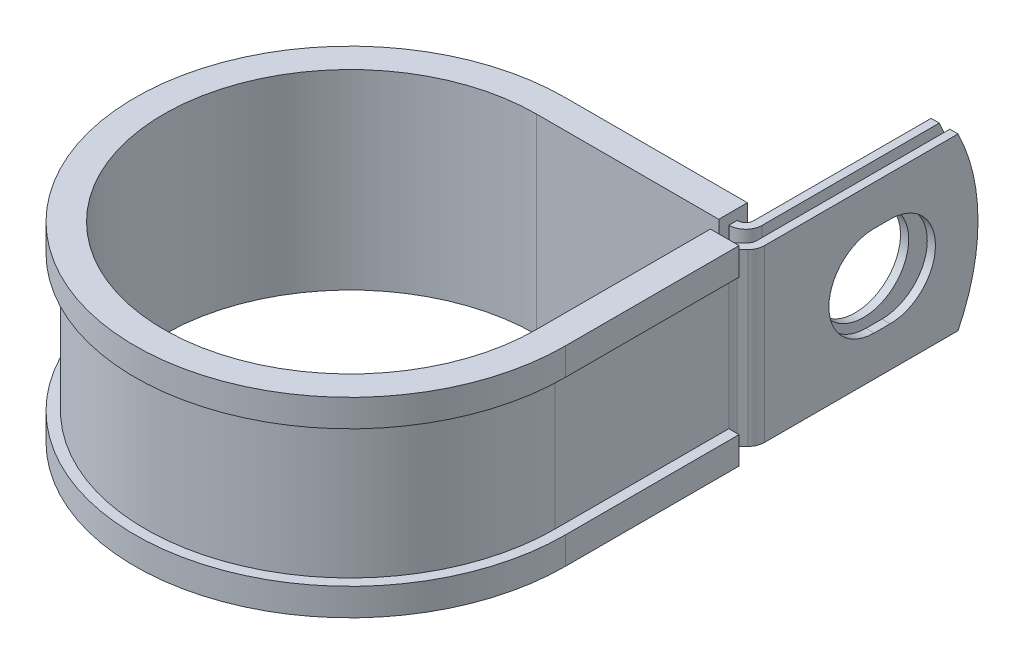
ISO-10303-21;
HEADER;
FILE_DESCRIPTION(('STEP AP214'),'2;1');
FILE_NAME('part.step','',(''),(''),'','','');
FILE_SCHEMA(('AUTOMOTIVE_DESIGN { 1 0 10303 214 1 1 1 1 }'));
ENDSEC;
DATA;
#1=APPLICATION_CONTEXT('core data for automotive mechanical design processes');
#2=APPLICATION_PROTOCOL_DEFINITION('international standard','automotive_design',2000,#1);
#3=PRODUCT_CONTEXT('',#1,'mechanical');
#4=PRODUCT('Part','Part','',(#3));
#5=PRODUCT_RELATED_PRODUCT_CATEGORY('part','',(#4));
#6=PRODUCT_DEFINITION_FORMATION('','',#4);
#7=PRODUCT_DEFINITION_CONTEXT('part definition',#1,'design');
#8=PRODUCT_DEFINITION('design','',#6,#7);
#9=PRODUCT_DEFINITION_SHAPE('','',#8);
#10=(LENGTH_UNIT() NAMED_UNIT(*) SI_UNIT(.MILLI.,.METRE.));
#11=(NAMED_UNIT(*) PLANE_ANGLE_UNIT() SI_UNIT($,.RADIAN.));
#12=(NAMED_UNIT(*) SI_UNIT($,.STERADIAN.) SOLID_ANGLE_UNIT());
#13=UNCERTAINTY_MEASURE_WITH_UNIT(LENGTH_MEASURE(1.E-05),#10,'distance_accuracy_value','');
#14=(GEOMETRIC_REPRESENTATION_CONTEXT(3) GLOBAL_UNCERTAINTY_ASSIGNED_CONTEXT((#13)) GLOBAL_UNIT_ASSIGNED_CONTEXT((#10,
#11,#12)) REPRESENTATION_CONTEXT('',''));
#15=CARTESIAN_POINT('',(0.,0.,0.));
#16=DIRECTION('',(0.,0.,1.));
#17=DIRECTION('',(1.,0.,0.));
#18=AXIS2_PLACEMENT_3D('',#15,#16,#17);
#19=CARTESIAN_POINT('',(29.9771698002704,-12.7,-29.2989));
#20=DIRECTION('',(0.,1.,0.));
#21=DIRECTION('',(1.,0.,0.));
#22=AXIS2_PLACEMENT_3D('',#19,#20,#21);
#23=PLANE('',#22);
#24=DIRECTION('',(0.,0.,-1.));
#25=VECTOR('',#24,1.);
#26=CARTESIAN_POINT('',(27.1323698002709,-12.7,-29.2989));
#27=LINE('',#26,#25);
#28=CARTESIAN_POINT('',(27.1323698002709,-12.7,-29.2989));
#29=VERTEX_POINT('',#28);
#30=CARTESIAN_POINT('',(27.1323698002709,-12.7,-30.5181));
#31=VERTEX_POINT('',#30);
#32=EDGE_CURVE('E523',#29,#31,#27,.T.);
#33=ORIENTED_EDGE('',*,*,#32,.T.);
#34=DIRECTION('',(-1.,0.,0.));
#35=VECTOR('',#34,1.);
#36=CARTESIAN_POINT('',(0.,-12.7,-30.5181));
#37=LINE('',#36,#35);
#38=CARTESIAN_POINT('',(27.1831698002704,-12.7,-30.5181));
#39=VERTEX_POINT('',#38);
#40=EDGE_CURVE('E410',#39,#31,#37,.T.);
#41=ORIENTED_EDGE('',*,*,#40,.F.);
#42=CARTESIAN_POINT('',(27.1831698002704,-12.7,-31.7373));
#43=DIRECTION('',(0.,1.,0.));
#44=DIRECTION('',(1.,0.,0.));
#45=AXIS2_PLACEMENT_3D('',#42,#43,#44);
#46=CIRCLE('',#45,1.2192);
#47=CARTESIAN_POINT('',(28.4023698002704,-12.7,-31.7373));
#48=VERTEX_POINT('',#47);
#49=EDGE_CURVE('E408',#48,#39,#46,.F.);
#50=ORIENTED_EDGE('',*,*,#49,.F.);
#51=DIRECTION('',(0.,0.,1.));
#52=VECTOR('',#51,1.);
#53=CARTESIAN_POINT('',(28.4023698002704,-12.7,-61.1124));
#54=LINE('',#53,#52);
#55=CARTESIAN_POINT('',(28.4023698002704,-12.7,-58.1350683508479));
#56=VERTEX_POINT('',#55);
#57=EDGE_CURVE('E406',#56,#48,#54,.T.);
#58=ORIENTED_EDGE('',*,*,#57,.F.);
#59=DIRECTION('',(-1.,0.,0.));
#60=VECTOR('',#59,1.);
#61=CARTESIAN_POINT('',(32.4155698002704,-12.7,-58.1350683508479));
#62=LINE('',#61,#60);
#63=CARTESIAN_POINT('',(29.6215698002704,-12.7,-58.1350683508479));
#64=VERTEX_POINT('',#63);
#65=EDGE_CURVE('E12',#64,#56,#62,.T.);
#66=ORIENTED_EDGE('',*,*,#65,.F.);
#67=DIRECTION('',(0.,0.,1.));
#68=VECTOR('',#67,1.);
#69=CARTESIAN_POINT('',(29.6215698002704,-12.7,-61.1124));
#70=LINE('',#69,#68);
#71=CARTESIAN_POINT('',(29.6215698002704,-12.7,-31.7373));
#72=VERTEX_POINT('',#71);
#73=EDGE_CURVE('E404',#64,#72,#70,.T.);
#74=ORIENTED_EDGE('',*,*,#73,.T.);
#75=CARTESIAN_POINT('',(27.1831698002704,-12.7,-31.7373));
#76=DIRECTION('',(0.,-1.,0.));
#77=DIRECTION('',(0.,0.,1.));
#78=AXIS2_PLACEMENT_3D('',#75,#76,#77);
#79=CIRCLE('',#78,2.4384);
#80=CARTESIAN_POINT('',(27.1831698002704,-12.7,-29.2989));
#81=VERTEX_POINT('',#80);
#82=EDGE_CURVE('E401',#72,#81,#79,.T.);
#83=ORIENTED_EDGE('',*,*,#82,.T.);
#84=DIRECTION('',(-1.,0.,0.));
#85=VECTOR('',#84,1.);
#86=CARTESIAN_POINT('',(0.,-12.7,-29.2989));
#87=LINE('',#86,#85);
#88=EDGE_CURVE('E398',#81,#29,#87,.T.);
#89=ORIENTED_EDGE('',*,*,#88,.T.);
#90=EDGE_LOOP('',(#33,#41,#50,#58,#66,#74,#83,#89));
#91=FACE_BOUND('',#90,.T.);
#92=ADVANCED_FACE('F54',(#91),#23,.F.);
#93=CARTESIAN_POINT('',(29.9771698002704,12.7,-29.2989));
#94=DIRECTION('',(0.,1.,0.));
#95=DIRECTION('',(1.,0.,0.));
#96=AXIS2_PLACEMENT_3D('',#93,#94,#95);
#97=PLANE('',#96);
#98=DIRECTION('',(-1.,0.,0.));
#99=VECTOR('',#98,1.);
#100=CARTESIAN_POINT('',(0.,12.7,-30.5181));
#101=LINE('',#100,#99);
#102=CARTESIAN_POINT('',(27.1831698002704,12.7,-30.5181));
#103=VERTEX_POINT('',#102);
#104=CARTESIAN_POINT('',(27.1323698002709,12.7,-30.5181));
#105=VERTEX_POINT('',#104);
#106=EDGE_CURVE('E368',#103,#105,#101,.T.);
#107=ORIENTED_EDGE('',*,*,#106,.T.);
#108=DIRECTION('',(0.,0.,1.));
#109=VECTOR('',#108,1.);
#110=CARTESIAN_POINT('',(27.1323698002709,12.7,-30.5181));
#111=LINE('',#110,#109);
#112=CARTESIAN_POINT('',(27.1323698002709,12.7,-29.2989));
#113=VERTEX_POINT('',#112);
#114=EDGE_CURVE('E517',#105,#113,#111,.T.);
#115=ORIENTED_EDGE('',*,*,#114,.T.);
#116=DIRECTION('',(-1.,0.,0.));
#117=VECTOR('',#116,1.);
#118=CARTESIAN_POINT('',(0.,12.7,-29.2989));
#119=LINE('',#118,#117);
#120=CARTESIAN_POINT('',(27.1831698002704,12.7,-29.2989));
#121=VERTEX_POINT('',#120);
#122=EDGE_CURVE('E625',#121,#113,#119,.T.);
#123=ORIENTED_EDGE('',*,*,#122,.F.);
#124=CARTESIAN_POINT('',(27.1831698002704,12.7,-31.7373));
#125=DIRECTION('',(0.,-1.,0.));
#126=DIRECTION('',(0.,0.,1.));
#127=AXIS2_PLACEMENT_3D('',#124,#125,#126);
#128=CIRCLE('',#127,2.4384);
#129=CARTESIAN_POINT('',(29.6215698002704,12.7,-31.7373));
#130=VERTEX_POINT('',#129);
#131=EDGE_CURVE('E370',#130,#121,#128,.T.);
#132=ORIENTED_EDGE('',*,*,#131,.F.);
#133=DIRECTION('',(0.,0.,1.));
#134=VECTOR('',#133,1.);
#135=CARTESIAN_POINT('',(29.6215698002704,12.7,-61.1124));
#136=LINE('',#135,#134);
#137=CARTESIAN_POINT('',(29.6215698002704,12.7,-58.1350683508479));
#138=VERTEX_POINT('',#137);
#139=EDGE_CURVE('E361',#138,#130,#136,.T.);
#140=ORIENTED_EDGE('',*,*,#139,.F.);
#141=DIRECTION('',(-1.,0.,0.));
#142=VECTOR('',#141,1.);
#143=CARTESIAN_POINT('',(32.4155698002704,12.7,-58.1350683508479));
#144=LINE('',#143,#142);
#145=CARTESIAN_POINT('',(28.4023698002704,12.7,-58.1350683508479));
#146=VERTEX_POINT('',#145);
#147=EDGE_CURVE('E62',#138,#146,#144,.T.);
#148=ORIENTED_EDGE('',*,*,#147,.T.);
#149=DIRECTION('',(0.,0.,1.));
#150=VECTOR('',#149,1.);
#151=CARTESIAN_POINT('',(28.4023698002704,12.7,-61.1124));
#152=LINE('',#151,#150);
#153=CARTESIAN_POINT('',(28.4023698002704,12.7,-31.7373));
#154=VERTEX_POINT('',#153);
#155=EDGE_CURVE('E358',#146,#154,#152,.T.);
#156=ORIENTED_EDGE('',*,*,#155,.T.);
#157=CARTESIAN_POINT('',(27.1831698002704,12.7,-31.7373));
#158=DIRECTION('',(0.,1.,0.));
#159=DIRECTION('',(1.,0.,0.));
#160=AXIS2_PLACEMENT_3D('',#157,#158,#159);
#161=CIRCLE('',#160,1.2192);
#162=EDGE_CURVE('E366',#154,#103,#161,.F.);
#163=ORIENTED_EDGE('',*,*,#162,.T.);
#164=EDGE_LOOP('',(#107,#115,#123,#132,#140,#148,#156,#163));
#165=FACE_BOUND('',#164,.T.);
#166=ADVANCED_FACE('F357',(#165),#97,.T.);
#167=CARTESIAN_POINT('',(0.,12.7,-29.2989));
#168=DIRECTION('',(0.,0.,1.));
#169=DIRECTION('',(1.,0.,0.));
#170=AXIS2_PLACEMENT_3D('',#167,#168,#169);
#171=PLANE('',#170);
#172=ORIENTED_EDGE('',*,*,#122,.T.);
#173=DIRECTION('',(0.,-1.,0.));
#174=VECTOR('',#173,1.);
#175=CARTESIAN_POINT('',(27.1323698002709,12.7,-29.2989));
#176=LINE('',#175,#174);
#177=EDGE_CURVE('E520',#113,#29,#176,.T.);
#178=ORIENTED_EDGE('',*,*,#177,.T.);
#179=ORIENTED_EDGE('',*,*,#88,.F.);
#180=DIRECTION('',(0.,-1.,0.));
#181=VECTOR('',#180,1.);
#182=CARTESIAN_POINT('',(27.1831698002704,12.7,-29.2989));
#183=LINE('',#182,#181);
#184=EDGE_CURVE('E344',#121,#81,#183,.T.);
#185=ORIENTED_EDGE('',*,*,#184,.F.);
#186=EDGE_LOOP('',(#172,#178,#179,#185));
#187=FACE_BOUND('',#186,.T.);
#188=ADVANCED_FACE('F635',(#187),#171,.T.);
#189=CARTESIAN_POINT('',(32.4155698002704,12.7,-29.2989));
#190=DIRECTION('',(-1.,0.,0.));
#191=DIRECTION('',(0.,0.,1.));
#192=AXIS2_PLACEMENT_3D('',#189,#190,#191);
#193=PLANE('',#192);
#194=CARTESIAN_POINT('',(32.4155698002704,0.,-48.0313999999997));
#195=DIRECTION('',(1.,0.,0.));
#196=DIRECTION('',(0.,0.,-1.));
#197=AXIS2_PLACEMENT_3D('',#194,#195,#196);
#198=CIRCLE('',#197,6.7437);
#199=CARTESIAN_POINT('',(32.4155698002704,-6.7437,-48.0314000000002));
#200=VERTEX_POINT('',#199);
#201=CARTESIAN_POINT('',(32.4155698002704,6.7437,-48.0314000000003));
#202=VERTEX_POINT('',#201);
#203=EDGE_CURVE('E580',#200,#202,#198,.T.);
#204=ORIENTED_EDGE('',*,*,#203,.F.);
#205=DIRECTION('',(0.,0.,-1.));
#206=VECTOR('',#205,1.);
#207=CARTESIAN_POINT('',(32.4155698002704,-6.7437,-45.6437999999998));
#208=LINE('',#207,#206);
#209=CARTESIAN_POINT('',(32.4155698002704,-6.7437,-45.6437999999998));
#210=VERTEX_POINT('',#209);
#211=EDGE_CURVE('E583',#210,#200,#208,.T.);
#212=ORIENTED_EDGE('',*,*,#211,.F.);
#213=CARTESIAN_POINT('',(32.4155698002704,0.,-45.6437999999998));
#214=DIRECTION('',(1.,0.,0.));
#215=DIRECTION('',(0.,0.,-1.));
#216=AXIS2_PLACEMENT_3D('',#213,#214,#215);
#217=CIRCLE('',#216,6.7437);
#218=CARTESIAN_POINT('',(32.4155698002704,6.7437,-45.6437999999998));
#219=VERTEX_POINT('',#218);
#220=EDGE_CURVE('E576',#219,#210,#217,.T.);
#221=ORIENTED_EDGE('',*,*,#220,.F.);
#222=DIRECTION('',(0.,0.,1.));
#223=VECTOR('',#222,1.);
#224=CARTESIAN_POINT('',(32.4155698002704,6.7437,-45.6437999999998));
#225=LINE('',#224,#223);
#226=EDGE_CURVE('E577',#202,#219,#225,.T.);
#227=ORIENTED_EDGE('',*,*,#226,.F.);
#228=EDGE_LOOP('',(#204,#212,#221,#227));
#229=FACE_BOUND('',#228,.T.);
#230=DIRECTION('',(0.,0.,-1.));
#231=VECTOR('',#230,1.);
#232=CARTESIAN_POINT('',(32.4155698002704,-12.7,-29.2989));
#233=LINE('',#232,#231);
#234=CARTESIAN_POINT('',(32.4155698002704,-12.7,-29.2989));
#235=VERTEX_POINT('',#234);
#236=CARTESIAN_POINT('',(32.4155698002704,-12.7,-58.1350683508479));
#237=VERTEX_POINT('',#236);
#238=EDGE_CURVE('E382',#235,#237,#233,.T.);
#239=ORIENTED_EDGE('',*,*,#238,.T.);
#240=CARTESIAN_POINT('',(32.4155698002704,0.,-32.5374));
#241=DIRECTION('',(-1.,0.,0.));
#242=DIRECTION('',(0.,0.,1.));
#243=AXIS2_PLACEMENT_3D('',#240,#241,#242);
#244=CIRCLE('',#243,28.575);
#245=CARTESIAN_POINT('',(32.4155698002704,12.7,-58.1350683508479));
#246=VERTEX_POINT('',#245);
#247=EDGE_CURVE('E568',#246,#237,#244,.T.);
#248=ORIENTED_EDGE('',*,*,#247,.F.);
#249=DIRECTION('',(0.,0.,-1.));
#250=VECTOR('',#249,1.);
#251=CARTESIAN_POINT('',(32.4155698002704,12.7,-29.2989));
#252=LINE('',#251,#250);
#253=CARTESIAN_POINT('',(32.4155698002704,12.7,-29.2989));
#254=VERTEX_POINT('',#253);
#255=EDGE_CURVE('E419',#254,#246,#252,.T.);
#256=ORIENTED_EDGE('',*,*,#255,.F.);
#257=DIRECTION('',(0.,-1.,0.));
#258=VECTOR('',#257,1.);
#259=CARTESIAN_POINT('',(32.4155698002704,12.7,-29.2989));
#260=LINE('',#259,#258);
#261=EDGE_CURVE('E381',#254,#235,#260,.T.);
#262=ORIENTED_EDGE('',*,*,#261,.T.);
#263=EDGE_LOOP('',(#239,#248,#256,#262));
#264=FACE_BOUND('',#263,.T.);
#265=ADVANCED_FACE('F56',(#229,#264),#193,.F.);
#266=CARTESIAN_POINT('',(31.1963698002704,12.7,-29.2989));
#267=DIRECTION('',(-1.,0.,0.));
#268=DIRECTION('',(0.,0.,1.));
#269=AXIS2_PLACEMENT_3D('',#266,#267,#268);
#270=PLANE('',#269);
#271=DIRECTION('',(0.,0.,-1.));
#272=VECTOR('',#271,1.);
#273=CARTESIAN_POINT('',(31.1963698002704,-6.7437,-45.6437999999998));
#274=LINE('',#273,#272);
#275=CARTESIAN_POINT('',(31.1963698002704,-6.7437,-45.6437999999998));
#276=VERTEX_POINT('',#275);
#277=CARTESIAN_POINT('',(31.1963698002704,-6.7437,-48.0314000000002));
#278=VERTEX_POINT('',#277);
#279=EDGE_CURVE('E579',#276,#278,#274,.T.);
#280=ORIENTED_EDGE('',*,*,#279,.T.);
#281=CARTESIAN_POINT('',(31.1963698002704,0.,-48.0313999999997));
#282=DIRECTION('',(-1.,0.,0.));
#283=DIRECTION('',(0.,0.,1.));
#284=AXIS2_PLACEMENT_3D('',#281,#282,#283);
#285=CIRCLE('',#284,6.7437);
#286=CARTESIAN_POINT('',(31.1963698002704,6.7437,-48.0314000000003));
#287=VERTEX_POINT('',#286);
#288=EDGE_CURVE('E600',#278,#287,#285,.F.);
#289=ORIENTED_EDGE('',*,*,#288,.T.);
#290=DIRECTION('',(0.,0.,1.));
#291=VECTOR('',#290,1.);
#292=CARTESIAN_POINT('',(31.1963698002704,6.7437,-45.6437999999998));
#293=LINE('',#292,#291);
#294=CARTESIAN_POINT('',(31.1963698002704,6.7437,-45.6437999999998));
#295=VERTEX_POINT('',#294);
#296=EDGE_CURVE('E596',#287,#295,#293,.T.);
#297=ORIENTED_EDGE('',*,*,#296,.T.);
#298=CARTESIAN_POINT('',(31.1963698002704,0.,-45.6437999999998));
#299=DIRECTION('',(-1.,0.,0.));
#300=DIRECTION('',(0.,0.,1.));
#301=AXIS2_PLACEMENT_3D('',#298,#299,#300);
#302=CIRCLE('',#301,6.7437);
#303=EDGE_CURVE('E591',#295,#276,#302,.F.);
#304=ORIENTED_EDGE('',*,*,#303,.T.);
#305=EDGE_LOOP('',(#280,#289,#297,#304));
#306=FACE_BOUND('',#305,.T.);
#307=CARTESIAN_POINT('',(31.1963698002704,0.,-32.5374));
#308=DIRECTION('',(-1.,0.,0.));
#309=DIRECTION('',(0.,0.,1.));
#310=AXIS2_PLACEMENT_3D('',#307,#308,#309);
#311=CIRCLE('',#310,28.575);
#312=CARTESIAN_POINT('',(31.1963698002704,12.7,-58.1350683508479));
#313=VERTEX_POINT('',#312);
#314=CARTESIAN_POINT('',(31.1963698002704,-12.7,-58.1350683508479));
#315=VERTEX_POINT('',#314);
#316=EDGE_CURVE('E76',#313,#315,#311,.T.);
#317=ORIENTED_EDGE('',*,*,#316,.T.);
#318=DIRECTION('',(0.,0.,-1.));
#319=VECTOR('',#318,1.);
#320=CARTESIAN_POINT('',(31.1963698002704,-12.7,-29.2989));
#321=LINE('',#320,#319);
#322=CARTESIAN_POINT('',(31.1963698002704,-12.7,-29.2989));
#323=VERTEX_POINT('',#322);
#324=EDGE_CURVE('E385',#323,#315,#321,.T.);
#325=ORIENTED_EDGE('',*,*,#324,.F.);
#326=DIRECTION('',(0.,-1.,0.));
#327=VECTOR('',#326,1.);
#328=CARTESIAN_POINT('',(31.1963698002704,12.7,-29.2989));
#329=LINE('',#328,#327);
#330=CARTESIAN_POINT('',(31.1963698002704,12.7,-29.2989));
#331=VERTEX_POINT('',#330);
#332=EDGE_CURVE('E352',#331,#323,#329,.T.);
#333=ORIENTED_EDGE('',*,*,#332,.F.);
#334=DIRECTION('',(0.,0.,-1.));
#335=VECTOR('',#334,1.);
#336=CARTESIAN_POINT('',(31.1963698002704,12.7,-29.2989));
#337=LINE('',#336,#335);
#338=EDGE_CURVE('E615',#331,#313,#337,.T.);
#339=ORIENTED_EDGE('',*,*,#338,.T.);
#340=EDGE_LOOP('',(#317,#325,#333,#339));
#341=FACE_BOUND('',#340,.T.);
#342=ADVANCED_FACE('F689',(#306,#341),#270,.T.);
#343=CARTESIAN_POINT('',(29.6215698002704,12.7,-61.1124));
#344=DIRECTION('',(1.,0.,0.));
#345=DIRECTION('',(0.,0.,-1.));
#346=AXIS2_PLACEMENT_3D('',#343,#344,#345);
#347=PLANE('',#346);
#348=CARTESIAN_POINT('',(29.6215698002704,0.,-46.8376));
#349=DIRECTION('',(1.,0.,0.));
#350=DIRECTION('',(0.,0.,-1.));
#351=AXIS2_PLACEMENT_3D('',#348,#349,#350);
#352=CIRCLE('',#351,6.7437);
#353=CARTESIAN_POINT('',(29.6215698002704,0.,-53.5813));
#354=VERTEX_POINT('',#353);
#355=EDGE_CURVE('E386',#354,#354,#352,.F.);
#356=ORIENTED_EDGE('',*,*,#355,.T.);
#357=EDGE_LOOP('',(#356));
#358=FACE_BOUND('',#357,.T.);
#359=ORIENTED_EDGE('',*,*,#73,.F.);
#360=CARTESIAN_POINT('',(29.6215698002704,0.,-32.5374));
#361=DIRECTION('',(1.,0.,0.));
#362=DIRECTION('',(0.,0.,-1.));
#363=AXIS2_PLACEMENT_3D('',#360,#361,#362);
#364=CIRCLE('',#363,28.575);
#365=EDGE_CURVE('E573',#64,#138,#364,.T.);
#366=ORIENTED_EDGE('',*,*,#365,.T.);
#367=ORIENTED_EDGE('',*,*,#139,.T.);
#368=DIRECTION('',(0.,-1.,0.));
#369=VECTOR('',#368,1.);
#370=CARTESIAN_POINT('',(29.6215698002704,12.7,-31.7373));
#371=LINE('',#370,#369);
#372=EDGE_CURVE('E341',#130,#72,#371,.T.);
#373=ORIENTED_EDGE('',*,*,#372,.T.);
#374=EDGE_LOOP('',(#359,#366,#367,#373));
#375=FACE_BOUND('',#374,.T.);
#376=ADVANCED_FACE('F641',(#358,#375),#347,.T.);
#377=CARTESIAN_POINT('',(28.4023698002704,12.7,-61.1124));
#378=DIRECTION('',(1.,0.,0.));
#379=DIRECTION('',(0.,0.,-1.));
#380=AXIS2_PLACEMENT_3D('',#377,#378,#379);
#381=PLANE('',#380);
#382=CARTESIAN_POINT('',(28.4023698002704,0.,-46.8376));
#383=DIRECTION('',(-1.,0.,0.));
#384=DIRECTION('',(0.,0.,1.));
#385=AXIS2_PLACEMENT_3D('',#382,#383,#384);
#386=CIRCLE('',#385,6.7437);
#387=CARTESIAN_POINT('',(28.4023698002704,0.,-40.0939));
#388=VERTEX_POINT('',#387);
#389=EDGE_CURVE('E608',#388,#388,#386,.T.);
#390=ORIENTED_EDGE('',*,*,#389,.F.);
#391=EDGE_LOOP('',(#390));
#392=FACE_BOUND('',#391,.T.);
#393=CARTESIAN_POINT('',(28.4023698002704,0.,-32.5374));
#394=DIRECTION('',(-1.,0.,0.));
#395=DIRECTION('',(0.,0.,1.));
#396=AXIS2_PLACEMENT_3D('',#393,#394,#395);
#397=CIRCLE('',#396,28.575);
#398=EDGE_CURVE('E68',#146,#56,#397,.T.);
#399=ORIENTED_EDGE('',*,*,#398,.T.);
#400=ORIENTED_EDGE('',*,*,#57,.T.);
#401=DIRECTION('',(0.,-1.,0.));
#402=VECTOR('',#401,1.);
#403=CARTESIAN_POINT('',(28.4023698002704,12.7,-31.7373));
#404=LINE('',#403,#402);
#405=EDGE_CURVE('E338',#154,#48,#404,.T.);
#406=ORIENTED_EDGE('',*,*,#405,.F.);
#407=ORIENTED_EDGE('',*,*,#155,.F.);
#408=EDGE_LOOP('',(#399,#400,#406,#407));
#409=FACE_BOUND('',#408,.T.);
#410=ADVANCED_FACE('F364',(#392,#409),#381,.F.);
#411=CARTESIAN_POINT('',(31.7373,-12.7,-25.8864026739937));
#412=DIRECTION('',(0.,1.,0.));
#413=DIRECTION('',(1.,0.,0.));
#414=AXIS2_PLACEMENT_3D('',#411,#412,#413);
#415=CIRCLE('',#414,1.2192);
#416=CARTESIAN_POINT('',(30.5181,-12.7,-25.8864026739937));
#417=VERTEX_POINT('',#416);
#418=CARTESIAN_POINT('',(30.8751954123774,-12.7,-26.7485072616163));
#419=VERTEX_POINT('',#418);
#420=EDGE_CURVE('E413',#417,#419,#415,.F.);
#421=ORIENTED_EDGE('',*,*,#420,.F.);
#422=DIRECTION('',(1.,0.,0.));
#423=VECTOR('',#422,1.);
#424=CARTESIAN_POINT('',(29.2989,-12.7,-25.8864026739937));
#425=LINE('',#424,#423);
#426=CARTESIAN_POINT('',(29.2989,-12.7,-25.8864026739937));
#427=VERTEX_POINT('',#426);
#428=EDGE_CURVE('E451',#427,#417,#425,.T.);
#429=ORIENTED_EDGE('',*,*,#428,.F.);
#430=CARTESIAN_POINT('',(31.7373,-12.7,-25.8864026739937));
#431=DIRECTION('',(0.,-1.,0.));
#432=DIRECTION('',(0.,0.,1.));
#433=AXIS2_PLACEMENT_3D('',#430,#431,#432);
#434=CIRCLE('',#433,2.4384);
#435=CARTESIAN_POINT('',(30.0130908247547,-12.7,-27.610611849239));
#436=VERTEX_POINT('',#435);
#437=EDGE_CURVE('E395',#427,#436,#434,.T.);
#438=ORIENTED_EDGE('',*,*,#437,.T.);
#439=DIRECTION('',(0.707106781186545,0.,-0.70710678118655));
#440=VECTOR('',#439,1.);
#441=CARTESIAN_POINT('',(30.0130908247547,-12.7,-27.610611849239));
#442=LINE('',#441,#440);
#443=CARTESIAN_POINT('',(30.8392743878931,-12.7,-28.4367954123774));
#444=VERTEX_POINT('',#443);
#445=EDGE_CURVE('E392',#436,#444,#442,.T.);
#446=ORIENTED_EDGE('',*,*,#445,.T.);
#447=CARTESIAN_POINT('',(29.9771698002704,-12.7,-29.2989));
#448=DIRECTION('',(0.,1.,0.));
#449=DIRECTION('',(0.,0.,1.));
#450=AXIS2_PLACEMENT_3D('',#447,#448,#449);
#451=CIRCLE('',#450,1.2192);
#452=EDGE_CURVE('E389',#444,#323,#451,.T.);
#453=ORIENTED_EDGE('',*,*,#452,.T.);
#454=ORIENTED_EDGE('',*,*,#324,.T.);
#455=DIRECTION('',(-1.,0.,0.));
#456=VECTOR('',#455,1.);
#457=CARTESIAN_POINT('',(32.4155698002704,-12.7,-58.1350683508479));
#458=LINE('',#457,#456);
#459=EDGE_CURVE('E566',#237,#315,#458,.T.);
#460=ORIENTED_EDGE('',*,*,#459,.F.);
#461=ORIENTED_EDGE('',*,*,#238,.F.);
#462=CARTESIAN_POINT('',(29.9771698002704,-12.7,-29.2989));
#463=DIRECTION('',(0.,1.,0.));
#464=DIRECTION('',(1.,0.,0.));
#465=AXIS2_PLACEMENT_3D('',#462,#463,#464);
#466=CIRCLE('',#465,2.4384);
#467=CARTESIAN_POINT('',(31.7013789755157,-12.7,-27.5746908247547));
#468=VERTEX_POINT('',#467);
#469=EDGE_CURVE('E417',#468,#235,#466,.T.);
#470=ORIENTED_EDGE('',*,*,#469,.F.);
#471=DIRECTION('',(0.707106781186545,0.,-0.70710678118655));
#472=VECTOR('',#471,1.);
#473=CARTESIAN_POINT('',(30.8751954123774,-12.7,-26.7485072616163));
#474=LINE('',#473,#472);
#475=EDGE_CURVE('E415',#419,#468,#474,.T.);
#476=ORIENTED_EDGE('',*,*,#475,.F.);
#477=EDGE_LOOP('',(#421,#429,#438,#446,#453,#454,#460,#461,#470,#476));
#478=FACE_BOUND('',#477,.T.);
#479=ADVANCED_FACE('F675',(#478),#23,.F.);
#480=DIRECTION('',(-1.,0.,0.));
#481=VECTOR('',#480,1.);
#482=CARTESIAN_POINT('',(30.5181,12.7,-25.8864026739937));
#483=LINE('',#482,#481);
#484=CARTESIAN_POINT('',(30.5181,12.7,-25.8864026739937));
#485=VERTEX_POINT('',#484);
#486=CARTESIAN_POINT('',(29.2989,12.7,-25.8864026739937));
#487=VERTEX_POINT('',#486);
#488=EDGE_CURVE('E440',#485,#487,#483,.T.);
#489=ORIENTED_EDGE('',*,*,#488,.F.);
#490=CARTESIAN_POINT('',(31.7373,12.7,-25.8864026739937));
#491=DIRECTION('',(0.,1.,0.));
#492=DIRECTION('',(1.,0.,0.));
#493=AXIS2_PLACEMENT_3D('',#490,#491,#492);
#494=CIRCLE('',#493,1.2192);
#495=CARTESIAN_POINT('',(30.8751954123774,12.7,-26.7485072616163));
#496=VERTEX_POINT('',#495);
#497=EDGE_CURVE('E375',#485,#496,#494,.F.);
#498=ORIENTED_EDGE('',*,*,#497,.T.);
#499=DIRECTION('',(0.707106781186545,0.,-0.70710678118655));
#500=VECTOR('',#499,1.);
#501=CARTESIAN_POINT('',(30.8751954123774,12.7,-26.7485072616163));
#502=LINE('',#501,#500);
#503=CARTESIAN_POINT('',(31.7013789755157,12.7,-27.5746908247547));
#504=VERTEX_POINT('',#503);
#505=EDGE_CURVE('E377',#496,#504,#502,.T.);
#506=ORIENTED_EDGE('',*,*,#505,.T.);
#507=CARTESIAN_POINT('',(29.9771698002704,12.7,-29.2989));
#508=DIRECTION('',(0.,1.,0.));
#509=DIRECTION('',(1.,0.,0.));
#510=AXIS2_PLACEMENT_3D('',#507,#508,#509);
#511=CIRCLE('',#510,2.4384);
#512=EDGE_CURVE('E379',#504,#254,#511,.T.);
#513=ORIENTED_EDGE('',*,*,#512,.T.);
#514=ORIENTED_EDGE('',*,*,#255,.T.);
#515=DIRECTION('',(-1.,0.,0.));
#516=VECTOR('',#515,1.);
#517=CARTESIAN_POINT('',(32.4155698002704,12.7,-58.1350683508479));
#518=LINE('',#517,#516);
#519=EDGE_CURVE('E570',#246,#313,#518,.T.);
#520=ORIENTED_EDGE('',*,*,#519,.T.);
#521=ORIENTED_EDGE('',*,*,#338,.F.);
#522=CARTESIAN_POINT('',(29.9771698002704,12.7,-29.2989));
#523=DIRECTION('',(0.,1.,0.));
#524=DIRECTION('',(0.,0.,1.));
#525=AXIS2_PLACEMENT_3D('',#522,#523,#524);
#526=CIRCLE('',#525,1.2192);
#527=CARTESIAN_POINT('',(30.8392743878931,12.7,-28.4367954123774));
#528=VERTEX_POINT('',#527);
#529=EDGE_CURVE('E618',#528,#331,#526,.T.);
#530=ORIENTED_EDGE('',*,*,#529,.F.);
#531=DIRECTION('',(0.707106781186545,0.,-0.70710678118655));
#532=VECTOR('',#531,1.);
#533=CARTESIAN_POINT('',(30.0130908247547,12.7,-27.610611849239));
#534=LINE('',#533,#532);
#535=CARTESIAN_POINT('',(30.0130908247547,12.7,-27.610611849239));
#536=VERTEX_POINT('',#535);
#537=EDGE_CURVE('E621',#536,#528,#534,.T.);
#538=ORIENTED_EDGE('',*,*,#537,.F.);
#539=CARTESIAN_POINT('',(31.7373,12.7,-25.8864026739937));
#540=DIRECTION('',(0.,-1.,0.));
#541=DIRECTION('',(0.,0.,1.));
#542=AXIS2_PLACEMENT_3D('',#539,#540,#541);
#543=CIRCLE('',#542,2.4384);
#544=EDGE_CURVE('E450',#487,#536,#543,.T.);
#545=ORIENTED_EDGE('',*,*,#544,.F.);
#546=EDGE_LOOP('',(#489,#498,#506,#513,#514,#520,#521,#530,#538,#545));
#547=FACE_BOUND('',#546,.T.);
#548=ADVANCED_FACE('F447',(#547),#97,.T.);
#549=CARTESIAN_POINT('',(29.9771698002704,12.7,-29.2989));
#550=DIRECTION('',(0.,-1.,0.));
#551=DIRECTION('',(0.,0.,-1.));
#552=AXIS2_PLACEMENT_3D('',#549,#550,#551);
#553=CYLINDRICAL_SURFACE('',#552,1.2192);
#554=ORIENTED_EDGE('',*,*,#452,.F.);
#555=DIRECTION('',(0.,-1.,0.));
#556=VECTOR('',#555,1.);
#557=CARTESIAN_POINT('',(30.8392743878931,12.7,-28.4367954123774));
#558=LINE('',#557,#556);
#559=EDGE_CURVE('E350',#528,#444,#558,.T.);
#560=ORIENTED_EDGE('',*,*,#559,.F.);
#561=ORIENTED_EDGE('',*,*,#529,.T.);
#562=ORIENTED_EDGE('',*,*,#332,.T.);
#563=EDGE_LOOP('',(#554,#560,#561,#562));
#564=FACE_BOUND('',#563,.T.);
#565=ADVANCED_FACE('F685',(#564),#553,.F.);
#566=CARTESIAN_POINT('',(30.0130908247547,12.7,-27.610611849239));
#567=DIRECTION('',(-0.70710678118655,0.,-0.707106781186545));
#568=DIRECTION('',(-0.707106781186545,0.,0.70710678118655));
#569=AXIS2_PLACEMENT_3D('',#566,#567,#568);
#570=PLANE('',#569);
#571=ORIENTED_EDGE('',*,*,#445,.F.);
#572=DIRECTION('',(0.,-1.,0.));
#573=VECTOR('',#572,1.);
#574=CARTESIAN_POINT('',(30.0130908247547,12.7,-27.610611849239));
#575=LINE('',#574,#573);
#576=EDGE_CURVE('E348',#536,#436,#575,.T.);
#577=ORIENTED_EDGE('',*,*,#576,.F.);
#578=ORIENTED_EDGE('',*,*,#537,.T.);
#579=ORIENTED_EDGE('',*,*,#559,.T.);
#580=EDGE_LOOP('',(#571,#577,#578,#579));
#581=FACE_BOUND('',#580,.T.);
#582=ADVANCED_FACE('F680',(#581),#570,.T.);
#583=CARTESIAN_POINT('',(31.7373,12.7,-25.8864026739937));
#584=DIRECTION('',(0.,-1.,0.));
#585=DIRECTION('',(0.,0.,-1.));
#586=AXIS2_PLACEMENT_3D('',#583,#584,#585);
#587=CYLINDRICAL_SURFACE('',#586,2.4384);
#588=ORIENTED_EDGE('',*,*,#437,.F.);
#589=DIRECTION('',(0.,-1.,0.));
#590=VECTOR('',#589,1.);
#591=CARTESIAN_POINT('',(29.2989,12.7,-25.8864026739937));
#592=LINE('',#591,#590);
#593=EDGE_CURVE('E346',#487,#427,#592,.T.);
#594=ORIENTED_EDGE('',*,*,#593,.F.);
#595=ORIENTED_EDGE('',*,*,#544,.T.);
#596=ORIENTED_EDGE('',*,*,#576,.T.);
#597=EDGE_LOOP('',(#588,#594,#595,#596));
#598=FACE_BOUND('',#597,.T.);
#599=ADVANCED_FACE('F677',(#598),#587,.T.);
#600=CARTESIAN_POINT('',(27.1831698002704,12.7,-31.7373));
#601=DIRECTION('',(0.,-1.,0.));
#602=DIRECTION('',(0.,0.,-1.));
#603=AXIS2_PLACEMENT_3D('',#600,#601,#602);
#604=CYLINDRICAL_SURFACE('',#603,2.4384);
#605=ORIENTED_EDGE('',*,*,#82,.F.);
#606=ORIENTED_EDGE('',*,*,#372,.F.);
#607=ORIENTED_EDGE('',*,*,#131,.T.);
#608=ORIENTED_EDGE('',*,*,#184,.T.);
#609=EDGE_LOOP('',(#605,#606,#607,#608));
#610=FACE_BOUND('',#609,.T.);
#611=ADVANCED_FACE('F631',(#610),#604,.T.);
#612=CARTESIAN_POINT('',(27.1831698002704,12.7,-31.7373));
#613=DIRECTION('',(0.,-1.,0.));
#614=DIRECTION('',(0.,0.,-1.));
#615=AXIS2_PLACEMENT_3D('',#612,#613,#614);
#616=CYLINDRICAL_SURFACE('',#615,1.2192);
#617=ORIENTED_EDGE('',*,*,#49,.T.);
#618=DIRECTION('',(0.,-1.,0.));
#619=VECTOR('',#618,1.);
#620=CARTESIAN_POINT('',(27.1831698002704,12.7,-30.5181));
#621=LINE('',#620,#619);
#622=EDGE_CURVE('E329',#103,#39,#621,.T.);
#623=ORIENTED_EDGE('',*,*,#622,.F.);
#624=ORIENTED_EDGE('',*,*,#162,.F.);
#625=ORIENTED_EDGE('',*,*,#405,.T.);
#626=EDGE_LOOP('',(#617,#623,#624,#625));
#627=FACE_BOUND('',#626,.T.);
#628=ADVANCED_FACE('F646',(#627),#616,.F.);
#629=CARTESIAN_POINT('',(0.,12.7,-30.5181));
#630=DIRECTION('',(0.,0.,1.));
#631=DIRECTION('',(1.,0.,0.));
#632=AXIS2_PLACEMENT_3D('',#629,#630,#631);
#633=PLANE('',#632);
#634=DIRECTION('',(0.,-1.,0.));
#635=VECTOR('',#634,1.);
#636=CARTESIAN_POINT('',(0.,12.7,-30.5181));
#637=LINE('',#636,#635);
#638=CARTESIAN_POINT('',(4.28082201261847E-13,10.16,-30.5181));
#639=VERTEX_POINT('',#638);
#640=CARTESIAN_POINT('',(4.28082201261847E-13,-10.16,-30.5181));
#641=VERTEX_POINT('',#640);
#642=EDGE_CURVE('E320',#639,#641,#637,.T.);
#643=ORIENTED_EDGE('',*,*,#642,.F.);
#644=DIRECTION('',(1.,0.,0.));
#645=VECTOR('',#644,1.);
#646=CARTESIAN_POINT('',(4.28082201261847E-13,10.16,-30.5181));
#647=LINE('',#646,#645);
#648=CARTESIAN_POINT('',(27.1323698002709,10.16,-30.5181));
#649=VERTEX_POINT('',#648);
#650=EDGE_CURVE('E563',#639,#649,#647,.T.);
#651=ORIENTED_EDGE('',*,*,#650,.T.);
#652=DIRECTION('',(0.,1.,0.));
#653=VECTOR('',#652,1.);
#654=CARTESIAN_POINT('',(27.1323698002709,12.7,-30.5181));
#655=LINE('',#654,#653);
#656=EDGE_CURVE('E514',#649,#105,#655,.T.);
#657=ORIENTED_EDGE('',*,*,#656,.T.);
#658=ORIENTED_EDGE('',*,*,#106,.F.);
#659=ORIENTED_EDGE('',*,*,#622,.T.);
#660=ORIENTED_EDGE('',*,*,#40,.T.);
#661=DIRECTION('',(0.,1.,0.));
#662=VECTOR('',#661,1.);
#663=CARTESIAN_POINT('',(27.1323698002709,-12.7,-30.5181));
#664=LINE('',#663,#662);
#665=CARTESIAN_POINT('',(27.1323698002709,-10.16,-30.5181));
#666=VERTEX_POINT('',#665);
#667=EDGE_CURVE('E526',#31,#666,#664,.T.);
#668=ORIENTED_EDGE('',*,*,#667,.T.);
#669=DIRECTION('',(1.,0.,0.));
#670=VECTOR('',#669,1.);
#671=CARTESIAN_POINT('',(4.28082201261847E-13,-10.16,-30.5181));
#672=LINE('',#671,#670);
#673=EDGE_CURVE('E543',#641,#666,#672,.T.);
#674=ORIENTED_EDGE('',*,*,#673,.F.);
#675=EDGE_LOOP('',(#643,#651,#657,#658,#659,#660,#668,#674));
#676=FACE_BOUND('',#675,.T.);
#677=ADVANCED_FACE('F650',(#676),#633,.F.);
#678=CARTESIAN_POINT('',(0.,12.7,0.));
#679=DIRECTION('',(0.,-1.,0.));
#680=DIRECTION('',(0.,0.,-1.));
#681=AXIS2_PLACEMENT_3D('',#678,#679,#680);
#682=CYLINDRICAL_SURFACE('',#681,30.5181);
#683=DIRECTION('',(0.,-1.,0.));
#684=VECTOR('',#683,1.);
#685=CARTESIAN_POINT('',(30.5181,12.7,0.));
#686=LINE('',#685,#684);
#687=CARTESIAN_POINT('',(30.5181,10.16,0.));
#688=VERTEX_POINT('',#687);
#689=CARTESIAN_POINT('',(30.5181,-10.16,0.));
#690=VERTEX_POINT('',#689);
#691=EDGE_CURVE('E318',#688,#690,#686,.T.);
#692=ORIENTED_EDGE('',*,*,#691,.F.);
#693=CARTESIAN_POINT('',(0.,10.16,0.));
#694=DIRECTION('',(0.,-1.,0.));
#695=DIRECTION('',(0.,0.,-1.));
#696=AXIS2_PLACEMENT_3D('',#693,#694,#695);
#697=CIRCLE('',#696,30.5181);
#698=EDGE_CURVE('E512',#688,#639,#697,.T.);
#699=ORIENTED_EDGE('',*,*,#698,.T.);
#700=ORIENTED_EDGE('',*,*,#642,.T.);
#701=CARTESIAN_POINT('',(0.,-10.16,0.));
#702=DIRECTION('',(0.,-1.,0.));
#703=DIRECTION('',(0.,0.,-1.));
#704=AXIS2_PLACEMENT_3D('',#701,#702,#703);
#705=CIRCLE('',#704,30.5181);
#706=EDGE_CURVE('E301',#690,#641,#705,.T.);
#707=ORIENTED_EDGE('',*,*,#706,.F.);
#708=EDGE_LOOP('',(#692,#699,#700,#707));
#709=FACE_BOUND('',#708,.T.);
#710=ADVANCED_FACE('F316',(#709),#682,.T.);
#711=CARTESIAN_POINT('',(30.5181,12.7,0.));
#712=DIRECTION('',(-1.,0.,0.));
#713=DIRECTION('',(0.,0.,1.));
#714=AXIS2_PLACEMENT_3D('',#711,#712,#713);
#715=PLANE('',#714);
#716=DIRECTION('',(0.,-1.,0.));
#717=VECTOR('',#716,1.);
#718=CARTESIAN_POINT('',(30.5181,12.7,-25.8864026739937));
#719=LINE('',#718,#717);
#720=CARTESIAN_POINT('',(30.5181,10.16,-25.8864026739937));
#721=VERTEX_POINT('',#720);
#722=CARTESIAN_POINT('',(30.5181,-10.16,-25.8864026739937));
#723=VERTEX_POINT('',#722);
#724=EDGE_CURVE('E332',#721,#723,#719,.T.);
#725=ORIENTED_EDGE('',*,*,#724,.F.);
#726=DIRECTION('',(0.,0.,-1.));
#727=VECTOR('',#726,1.);
#728=CARTESIAN_POINT('',(30.5181,10.16,0.));
#729=LINE('',#728,#727);
#730=EDGE_CURVE('E326',#688,#721,#729,.T.);
#731=ORIENTED_EDGE('',*,*,#730,.F.);
#732=ORIENTED_EDGE('',*,*,#691,.T.);
#733=DIRECTION('',(0.,0.,-1.));
#734=VECTOR('',#733,1.);
#735=CARTESIAN_POINT('',(30.5181,-10.16,0.));
#736=LINE('',#735,#734);
#737=EDGE_CURVE('E297',#690,#723,#736,.T.);
#738=ORIENTED_EDGE('',*,*,#737,.T.);
#739=EDGE_LOOP('',(#725,#731,#732,#738));
#740=FACE_BOUND('',#739,.T.);
#741=ADVANCED_FACE('F325',(#740),#715,.F.);
#742=CARTESIAN_POINT('',(31.7373,12.7,-25.8864026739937));
#743=DIRECTION('',(0.,-1.,0.));
#744=DIRECTION('',(0.,0.,-1.));
#745=AXIS2_PLACEMENT_3D('',#742,#743,#744);
#746=CYLINDRICAL_SURFACE('',#745,1.2192);
#747=ORIENTED_EDGE('',*,*,#420,.T.);
#748=DIRECTION('',(0.,-1.,0.));
#749=VECTOR('',#748,1.);
#750=CARTESIAN_POINT('',(30.8751954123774,12.7,-26.7485072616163));
#751=LINE('',#750,#749);
#752=EDGE_CURVE('E424',#496,#419,#751,.T.);
#753=ORIENTED_EDGE('',*,*,#752,.F.);
#754=ORIENTED_EDGE('',*,*,#497,.F.);
#755=EDGE_CURVE('E327',#485,#721,#719,.T.);
#756=ORIENTED_EDGE('',*,*,#755,.T.);
#757=ORIENTED_EDGE('',*,*,#724,.T.);
#758=DIRECTION('',(0.,1.,0.));
#759=VECTOR('',#758,1.);
#760=CARTESIAN_POINT('',(30.5181,-12.7,-25.8864026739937));
#761=LINE('',#760,#759);
#762=EDGE_CURVE('E433',#417,#723,#761,.T.);
#763=ORIENTED_EDGE('',*,*,#762,.F.);
#764=EDGE_LOOP('',(#747,#753,#754,#756,#757,#763));
#765=FACE_BOUND('',#764,.T.);
#766=ADVANCED_FACE('F432',(#765),#746,.F.);
#767=CARTESIAN_POINT('',(30.8751954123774,12.7,-26.7485072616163));
#768=DIRECTION('',(-0.70710678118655,0.,-0.707106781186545));
#769=DIRECTION('',(-0.707106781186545,0.,0.70710678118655));
#770=AXIS2_PLACEMENT_3D('',#767,#768,#769);
#771=PLANE('',#770);
#772=ORIENTED_EDGE('',*,*,#475,.T.);
#773=DIRECTION('',(0.,-1.,0.));
#774=VECTOR('',#773,1.);
#775=CARTESIAN_POINT('',(31.7013789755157,12.7,-27.5746908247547));
#776=LINE('',#775,#774);
#777=EDGE_CURVE('E422',#504,#468,#776,.T.);
#778=ORIENTED_EDGE('',*,*,#777,.F.);
#779=ORIENTED_EDGE('',*,*,#505,.F.);
#780=ORIENTED_EDGE('',*,*,#752,.T.);
#781=EDGE_LOOP('',(#772,#778,#779,#780));
#782=FACE_BOUND('',#781,.T.);
#783=ADVANCED_FACE('F701',(#782),#771,.F.);
#784=CARTESIAN_POINT('',(29.9771698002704,12.7,-29.2989));
#785=DIRECTION('',(0.,-1.,0.));
#786=DIRECTION('',(0.,0.,-1.));
#787=AXIS2_PLACEMENT_3D('',#784,#785,#786);
#788=CYLINDRICAL_SURFACE('',#787,2.4384);
#789=ORIENTED_EDGE('',*,*,#469,.T.);
#790=ORIENTED_EDGE('',*,*,#261,.F.);
#791=ORIENTED_EDGE('',*,*,#512,.F.);
#792=ORIENTED_EDGE('',*,*,#777,.T.);
#793=EDGE_LOOP('',(#789,#790,#791,#792));
#794=FACE_BOUND('',#793,.T.);
#795=ADVANCED_FACE('F699',(#794),#788,.T.);
#796=CARTESIAN_POINT('',(48.6956338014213,0.,-46.8376));
#797=DIRECTION('',(-1.,0.,0.));
#798=DIRECTION('',(0.,0.,1.));
#799=AXIS2_PLACEMENT_3D('',#796,#797,#798);
#800=CYLINDRICAL_SURFACE('',#799,6.7437);
#801=ORIENTED_EDGE('',*,*,#389,.T.);
#802=EDGE_LOOP('',(#801));
#803=FACE_BOUND('',#802,.T.);
#804=ORIENTED_EDGE('',*,*,#355,.F.);
#805=EDGE_LOOP('',(#804));
#806=FACE_BOUND('',#805,.T.);
#807=ADVANCED_FACE('F708',(#803,#806),#800,.F.);
#808=CARTESIAN_POINT('',(10.3654892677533,-6.7437,-45.6437999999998));
#809=DIRECTION('',(0.,-1.,0.));
#810=DIRECTION('',(0.,0.,-1.));
#811=AXIS2_PLACEMENT_3D('',#808,#809,#810);
#812=PLANE('',#811);
#813=DIRECTION('',(1.,0.,0.));
#814=VECTOR('',#813,1.);
#815=CARTESIAN_POINT('',(10.3654892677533,-6.7437,-45.6437999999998));
#816=LINE('',#815,#814);
#817=EDGE_CURVE('E594',#276,#210,#816,.T.);
#818=ORIENTED_EDGE('',*,*,#817,.T.);
#819=ORIENTED_EDGE('',*,*,#211,.T.);
#820=DIRECTION('',(1.,0.,0.));
#821=VECTOR('',#820,1.);
#822=CARTESIAN_POINT('',(10.3654892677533,-6.7437,-48.0314000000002));
#823=LINE('',#822,#821);
#824=EDGE_CURVE('E590',#278,#200,#823,.T.);
#825=ORIENTED_EDGE('',*,*,#824,.F.);
#826=ORIENTED_EDGE('',*,*,#279,.F.);
#827=EDGE_LOOP('',(#818,#819,#825,#826));
#828=FACE_BOUND('',#827,.T.);
#829=ADVANCED_FACE('F751',(#828),#812,.F.);
#830=CARTESIAN_POINT('',(10.3654892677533,0.,-48.0313999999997));
#831=DIRECTION('',(1.,0.,0.));
#832=DIRECTION('',(0.,0.,-1.));
#833=AXIS2_PLACEMENT_3D('',#830,#831,#832);
#834=CYLINDRICAL_SURFACE('',#833,6.7437);
#835=ORIENTED_EDGE('',*,*,#824,.T.);
#836=ORIENTED_EDGE('',*,*,#203,.T.);
#837=DIRECTION('',(1.,0.,0.));
#838=VECTOR('',#837,1.);
#839=CARTESIAN_POINT('',(10.3654892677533,6.7437,-48.0314000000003));
#840=LINE('',#839,#838);
#841=EDGE_CURVE('E599',#287,#202,#840,.T.);
#842=ORIENTED_EDGE('',*,*,#841,.F.);
#843=ORIENTED_EDGE('',*,*,#288,.F.);
#844=EDGE_LOOP('',(#835,#836,#842,#843));
#845=FACE_BOUND('',#844,.T.);
#846=ADVANCED_FACE('F755',(#845),#834,.F.);
#847=CARTESIAN_POINT('',(10.3654892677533,6.7437,-45.6437999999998));
#848=DIRECTION('',(0.,1.,0.));
#849=DIRECTION('',(0.,0.,1.));
#850=AXIS2_PLACEMENT_3D('',#847,#848,#849);
#851=PLANE('',#850);
#852=ORIENTED_EDGE('',*,*,#841,.T.);
#853=ORIENTED_EDGE('',*,*,#226,.T.);
#854=DIRECTION('',(1.,0.,0.));
#855=VECTOR('',#854,1.);
#856=CARTESIAN_POINT('',(10.3654892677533,6.7437,-45.6437999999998));
#857=LINE('',#856,#855);
#858=EDGE_CURVE('E595',#295,#219,#857,.T.);
#859=ORIENTED_EDGE('',*,*,#858,.F.);
#860=ORIENTED_EDGE('',*,*,#296,.F.);
#861=EDGE_LOOP('',(#852,#853,#859,#860));
#862=FACE_BOUND('',#861,.T.);
#863=ADVANCED_FACE('F759',(#862),#851,.F.);
#864=CARTESIAN_POINT('',(10.3654892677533,0.,-45.6437999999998));
#865=DIRECTION('',(1.,0.,0.));
#866=DIRECTION('',(0.,0.,-1.));
#867=AXIS2_PLACEMENT_3D('',#864,#865,#866);
#868=CYLINDRICAL_SURFACE('',#867,6.7437);
#869=ORIENTED_EDGE('',*,*,#858,.T.);
#870=ORIENTED_EDGE('',*,*,#220,.T.);
#871=ORIENTED_EDGE('',*,*,#817,.F.);
#872=ORIENTED_EDGE('',*,*,#303,.F.);
#873=EDGE_LOOP('',(#869,#870,#871,#872));
#874=FACE_BOUND('',#873,.T.);
#875=ADVANCED_FACE('F763',(#874),#868,.F.);
#876=CARTESIAN_POINT('',(32.4155698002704,0.,-32.5374));
#877=DIRECTION('',(-1.,0.,0.));
#878=DIRECTION('',(0.,0.,1.));
#879=AXIS2_PLACEMENT_3D('',#876,#877,#878);
#880=CYLINDRICAL_SURFACE('',#879,28.575);
#881=ORIENTED_EDGE('',*,*,#365,.F.);
#882=ORIENTED_EDGE('',*,*,#65,.T.);
#883=ORIENTED_EDGE('',*,*,#398,.F.);
#884=ORIENTED_EDGE('',*,*,#147,.F.);
#885=EDGE_LOOP('',(#881,#882,#883,#884));
#886=FACE_BOUND('',#885,.T.);
#887=ADVANCED_FACE('F642',(#886),#880,.T.);
#888=ORIENTED_EDGE('',*,*,#519,.F.);
#889=ORIENTED_EDGE('',*,*,#247,.T.);
#890=ORIENTED_EDGE('',*,*,#459,.T.);
#891=ORIENTED_EDGE('',*,*,#316,.F.);
#892=EDGE_LOOP('',(#888,#889,#890,#891));
#893=FACE_BOUND('',#892,.T.);
#894=ADVANCED_FACE('F690',(#893),#880,.T.);
#895=CARTESIAN_POINT('',(4.4945958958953E-13,14.224,-32.0421));
#896=DIRECTION('',(0.,0.,1.));
#897=DIRECTION('',(1.,0.,0.));
#898=AXIS2_PLACEMENT_3D('',#895,#896,#897);
#899=PLANE('',#898);
#900=DIRECTION('',(0.,-1.,0.));
#901=VECTOR('',#900,1.);
#902=CARTESIAN_POINT('',(4.4945958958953E-13,14.224,-32.0421));
#903=LINE('',#902,#901);
#904=CARTESIAN_POINT('',(4.4945958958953E-13,14.224,-32.0421));
#905=VERTEX_POINT('',#904);
#906=CARTESIAN_POINT('',(4.4945958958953E-13,10.16,-32.0421));
#907=VERTEX_POINT('',#906);
#908=EDGE_CURVE('E322',#905,#907,#903,.T.);
#909=ORIENTED_EDGE('',*,*,#908,.F.);
#910=DIRECTION('',(1.,0.,0.));
#911=VECTOR('',#910,1.);
#912=CARTESIAN_POINT('',(4.4945958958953E-13,14.224,-32.0421));
#913=LINE('',#912,#911);
#914=CARTESIAN_POINT('',(27.1323698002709,14.224,-32.0421));
#915=VERTEX_POINT('',#914);
#916=EDGE_CURVE('E557',#905,#915,#913,.T.);
#917=ORIENTED_EDGE('',*,*,#916,.T.);
#918=DIRECTION('',(0.,-1.,0.));
#919=VECTOR('',#918,1.);
#920=CARTESIAN_POINT('',(27.1323698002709,14.224,-32.0421));
#921=LINE('',#920,#919);
#922=CARTESIAN_POINT('',(27.1323698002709,10.16,-32.0421));
#923=VERTEX_POINT('',#922);
#924=EDGE_CURVE('E539',#915,#923,#921,.T.);
#925=ORIENTED_EDGE('',*,*,#924,.T.);
#926=DIRECTION('',(1.,0.,0.));
#927=VECTOR('',#926,1.);
#928=CARTESIAN_POINT('',(4.4945958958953E-13,10.16,-32.0421));
#929=LINE('',#928,#927);
#930=EDGE_CURVE('E560',#907,#923,#929,.T.);
#931=ORIENTED_EDGE('',*,*,#930,.F.);
#932=EDGE_LOOP('',(#909,#917,#925,#931));
#933=FACE_BOUND('',#932,.T.);
#934=ADVANCED_FACE('F854',(#933),#899,.F.);
#935=CARTESIAN_POINT('',(3.89602902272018E-13,14.224,-27.7749));
#936=DIRECTION('',(0.,0.,-1.));
#937=DIRECTION('',(0.,1.,0.));
#938=AXIS2_PLACEMENT_3D('',#935,#936,#937);
#939=PLANE('',#938);
#940=DIRECTION('',(0.,1.,0.));
#941=VECTOR('',#940,1.);
#942=CARTESIAN_POINT('',(3.89602902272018E-13,14.224,-27.7749));
#943=LINE('',#942,#941);
#944=CARTESIAN_POINT('',(3.89602902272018E-13,-14.224,-27.7749));
#945=VERTEX_POINT('',#944);
#946=CARTESIAN_POINT('',(3.89602902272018E-13,14.224,-27.7749));
#947=VERTEX_POINT('',#946);
#948=EDGE_CURVE('E490',#945,#947,#943,.T.);
#949=ORIENTED_EDGE('',*,*,#948,.F.);
#950=DIRECTION('',(1.,0.,0.));
#951=VECTOR('',#950,1.);
#952=CARTESIAN_POINT('',(3.89602902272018E-13,-14.224,-27.7749));
#953=LINE('',#952,#951);
#954=CARTESIAN_POINT('',(27.1323698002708,-14.224,-27.7749));
#955=VERTEX_POINT('',#954);
#956=EDGE_CURVE('E551',#945,#955,#953,.T.);
#957=ORIENTED_EDGE('',*,*,#956,.T.);
#958=DIRECTION('',(0.,1.,0.));
#959=VECTOR('',#958,1.);
#960=CARTESIAN_POINT('',(27.1323698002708,14.224,-27.7749));
#961=LINE('',#960,#959);
#962=CARTESIAN_POINT('',(27.1323698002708,14.224,-27.7749));
#963=VERTEX_POINT('',#962);
#964=EDGE_CURVE('E535',#955,#963,#961,.T.);
#965=ORIENTED_EDGE('',*,*,#964,.T.);
#966=DIRECTION('',(1.,0.,0.));
#967=VECTOR('',#966,1.);
#968=CARTESIAN_POINT('',(3.89602902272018E-13,14.224,-27.7749));
#969=LINE('',#968,#967);
#970=EDGE_CURVE('E554',#947,#963,#969,.T.);
#971=ORIENTED_EDGE('',*,*,#970,.F.);
#972=EDGE_LOOP('',(#949,#957,#965,#971));
#973=FACE_BOUND('',#972,.T.);
#974=ADVANCED_FACE('F940',(#973),#939,.F.);
#975=CARTESIAN_POINT('',(4.4945958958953E-13,-14.224,-32.0421));
#976=DIRECTION('',(0.,0.,1.));
#977=DIRECTION('',(1.,0.,0.));
#978=AXIS2_PLACEMENT_3D('',#975,#976,#977);
#979=PLANE('',#978);
#980=DIRECTION('',(0.,-1.,0.));
#981=VECTOR('',#980,1.);
#982=CARTESIAN_POINT('',(4.4945958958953E-13,-14.224,-32.0421));
#983=LINE('',#982,#981);
#984=CARTESIAN_POINT('',(4.4945958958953E-13,-10.16,-32.0421));
#985=VERTEX_POINT('',#984);
#986=CARTESIAN_POINT('',(4.4945958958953E-13,-14.224,-32.0421));
#987=VERTEX_POINT('',#986);
#988=EDGE_CURVE('E476',#985,#987,#983,.T.);
#989=ORIENTED_EDGE('',*,*,#988,.F.);
#990=DIRECTION('',(1.,0.,0.));
#991=VECTOR('',#990,1.);
#992=CARTESIAN_POINT('',(4.4945958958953E-13,-10.16,-32.0421));
#993=LINE('',#992,#991);
#994=CARTESIAN_POINT('',(27.1323698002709,-10.16,-32.0421));
#995=VERTEX_POINT('',#994);
#996=EDGE_CURVE('E545',#985,#995,#993,.T.);
#997=ORIENTED_EDGE('',*,*,#996,.T.);
#998=DIRECTION('',(0.,-1.,0.));
#999=VECTOR('',#998,1.);
#1000=CARTESIAN_POINT('',(27.1323698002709,-14.224,-32.0421));
#1001=LINE('',#1000,#999);
#1002=CARTESIAN_POINT('',(27.1323698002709,-14.224,-32.0421));
#1003=VERTEX_POINT('',#1002);
#1004=EDGE_CURVE('E531',#995,#1003,#1001,.T.);
#1005=ORIENTED_EDGE('',*,*,#1004,.T.);
#1006=DIRECTION('',(1.,0.,0.));
#1007=VECTOR('',#1006,1.);
#1008=CARTESIAN_POINT('',(4.4945958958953E-13,-14.224,-32.0421));
#1009=LINE('',#1008,#1007);
#1010=EDGE_CURVE('E548',#987,#1003,#1009,.T.);
#1011=ORIENTED_EDGE('',*,*,#1010,.F.);
#1012=EDGE_LOOP('',(#989,#997,#1005,#1011));
#1013=FACE_BOUND('',#1012,.T.);
#1014=ADVANCED_FACE('F661',(#1013),#979,.F.);
#1015=CARTESIAN_POINT('',(0.,12.7,0.));
#1016=DIRECTION('',(0.,-1.,0.));
#1017=DIRECTION('',(0.,0.,-1.));
#1018=AXIS2_PLACEMENT_3D('',#1015,#1016,#1017);
#1019=CYLINDRICAL_SURFACE('',#1018,32.0421);
#1020=DIRECTION('',(0.,-1.,0.));
#1021=VECTOR('',#1020,1.);
#1022=CARTESIAN_POINT('',(32.0421,14.224,0.));
#1023=LINE('',#1022,#1021);
#1024=CARTESIAN_POINT('',(32.0421,14.224,0.));
#1025=VERTEX_POINT('',#1024);
#1026=CARTESIAN_POINT('',(32.0421,10.16,0.));
#1027=VERTEX_POINT('',#1026);
#1028=EDGE_CURVE('E311',#1025,#1027,#1023,.T.);
#1029=ORIENTED_EDGE('',*,*,#1028,.F.);
#1030=CARTESIAN_POINT('',(0.,14.224,0.));
#1031=DIRECTION('',(0.,-1.,0.));
#1032=DIRECTION('',(0.,0.,-1.));
#1033=AXIS2_PLACEMENT_3D('',#1030,#1031,#1032);
#1034=CIRCLE('',#1033,32.0421);
#1035=EDGE_CURVE('E506',#1025,#905,#1034,.T.);
#1036=ORIENTED_EDGE('',*,*,#1035,.T.);
#1037=ORIENTED_EDGE('',*,*,#908,.T.);
#1038=CARTESIAN_POINT('',(0.,10.16,0.));
#1039=DIRECTION('',(0.,-1.,0.));
#1040=DIRECTION('',(0.,0.,-1.));
#1041=AXIS2_PLACEMENT_3D('',#1038,#1039,#1040);
#1042=CIRCLE('',#1041,32.0421);
#1043=EDGE_CURVE('E509',#1027,#907,#1042,.T.);
#1044=ORIENTED_EDGE('',*,*,#1043,.F.);
#1045=EDGE_LOOP('',(#1029,#1036,#1037,#1044));
#1046=FACE_BOUND('',#1045,.T.);
#1047=ADVANCED_FACE('F960',(#1046),#1019,.T.);
#1048=CARTESIAN_POINT('',(0.,12.7,0.));
#1049=DIRECTION('',(0.,-1.,0.));
#1050=DIRECTION('',(0.,0.,-1.));
#1051=AXIS2_PLACEMENT_3D('',#1048,#1049,#1050);
#1052=CYLINDRICAL_SURFACE('',#1051,27.7749);
#1053=DIRECTION('',(0.,1.,0.));
#1054=VECTOR('',#1053,1.);
#1055=CARTESIAN_POINT('',(27.7749,14.224,0.));
#1056=LINE('',#1055,#1054);
#1057=CARTESIAN_POINT('',(27.7749,-14.224,0.));
#1058=VERTEX_POINT('',#1057);
#1059=CARTESIAN_POINT('',(27.7749,14.224,0.));
#1060=VERTEX_POINT('',#1059);
#1061=EDGE_CURVE('E1123',#1058,#1060,#1056,.T.);
#1062=ORIENTED_EDGE('',*,*,#1061,.F.);
#1063=CARTESIAN_POINT('',(0.,-14.224,0.));
#1064=DIRECTION('',(0.,-1.,0.));
#1065=DIRECTION('',(0.,0.,-1.));
#1066=AXIS2_PLACEMENT_3D('',#1063,#1064,#1065);
#1067=CIRCLE('',#1066,27.7749);
#1068=EDGE_CURVE('E500',#1058,#945,#1067,.T.);
#1069=ORIENTED_EDGE('',*,*,#1068,.T.);
#1070=ORIENTED_EDGE('',*,*,#948,.T.);
#1071=CARTESIAN_POINT('',(0.,14.224,0.));
#1072=DIRECTION('',(0.,-1.,0.));
#1073=DIRECTION('',(0.,0.,-1.));
#1074=AXIS2_PLACEMENT_3D('',#1071,#1072,#1073);
#1075=CIRCLE('',#1074,27.7749);
#1076=EDGE_CURVE('E503',#1060,#947,#1075,.T.);
#1077=ORIENTED_EDGE('',*,*,#1076,.F.);
#1078=EDGE_LOOP('',(#1062,#1069,#1070,#1077));
#1079=FACE_BOUND('',#1078,.T.);
#1080=ADVANCED_FACE('F970',(#1079),#1052,.F.);
#1081=CARTESIAN_POINT('',(0.,12.7,0.));
#1082=DIRECTION('',(0.,-1.,0.));
#1083=DIRECTION('',(0.,0.,-1.));
#1084=AXIS2_PLACEMENT_3D('',#1081,#1082,#1083);
#1085=CYLINDRICAL_SURFACE('',#1084,32.0421);
#1086=DIRECTION('',(0.,-1.,0.));
#1087=VECTOR('',#1086,1.);
#1088=CARTESIAN_POINT('',(32.0421,-14.224,0.));
#1089=LINE('',#1088,#1087);
#1090=CARTESIAN_POINT('',(32.0421,-10.16,0.));
#1091=VERTEX_POINT('',#1090);
#1092=CARTESIAN_POINT('',(32.0421,-14.224,0.));
#1093=VERTEX_POINT('',#1092);
#1094=EDGE_CURVE('E474',#1091,#1093,#1089,.T.);
#1095=ORIENTED_EDGE('',*,*,#1094,.F.);
#1096=CARTESIAN_POINT('',(0.,-10.16,0.));
#1097=DIRECTION('',(0.,-1.,0.));
#1098=DIRECTION('',(0.,0.,-1.));
#1099=AXIS2_PLACEMENT_3D('',#1096,#1097,#1098);
#1100=CIRCLE('',#1099,32.0421);
#1101=EDGE_CURVE('E321',#1091,#985,#1100,.T.);
#1102=ORIENTED_EDGE('',*,*,#1101,.T.);
#1103=ORIENTED_EDGE('',*,*,#988,.T.);
#1104=CARTESIAN_POINT('',(0.,-14.224,0.));
#1105=DIRECTION('',(0.,-1.,0.));
#1106=DIRECTION('',(0.,0.,-1.));
#1107=AXIS2_PLACEMENT_3D('',#1104,#1105,#1106);
#1108=CIRCLE('',#1107,32.0421);
#1109=EDGE_CURVE('E497',#1093,#987,#1108,.T.);
#1110=ORIENTED_EDGE('',*,*,#1109,.F.);
#1111=EDGE_LOOP('',(#1095,#1102,#1103,#1110));
#1112=FACE_BOUND('',#1111,.T.);
#1113=ADVANCED_FACE('F664',(#1112),#1085,.T.);
#1114=CARTESIAN_POINT('',(32.0421,10.16,0.));
#1115=DIRECTION('',(0.,-1.,0.));
#1116=DIRECTION('',(0.,0.,-1.));
#1117=AXIS2_PLACEMENT_3D('',#1114,#1115,#1116);
#1118=PLANE('',#1117);
#1119=DIRECTION('',(-1.,0.,0.));
#1120=VECTOR('',#1119,1.);
#1121=CARTESIAN_POINT('',(32.0421,10.16,-25.8864026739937));
#1122=LINE('',#1121,#1120);
#1123=CARTESIAN_POINT('',(32.0421,10.16,-25.8864026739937));
#1124=VERTEX_POINT('',#1123);
#1125=EDGE_CURVE('E444',#1124,#721,#1122,.T.);
#1126=ORIENTED_EDGE('',*,*,#1125,.F.);
#1127=DIRECTION('',(0.,0.,-1.));
#1128=VECTOR('',#1127,1.);
#1129=CARTESIAN_POINT('',(32.0421,10.16,0.));
#1130=LINE('',#1129,#1128);
#1131=EDGE_CURVE('E477',#1027,#1124,#1130,.T.);
#1132=ORIENTED_EDGE('',*,*,#1131,.F.);
#1133=ORIENTED_EDGE('',*,*,#1043,.T.);
#1134=ORIENTED_EDGE('',*,*,#930,.T.);
#1135=DIRECTION('',(0.,0.,1.));
#1136=VECTOR('',#1135,1.);
#1137=CARTESIAN_POINT('',(27.1323698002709,10.16,-32.0421));
#1138=LINE('',#1137,#1136);
#1139=EDGE_CURVE('E541',#923,#649,#1138,.T.);
#1140=ORIENTED_EDGE('',*,*,#1139,.T.);
#1141=ORIENTED_EDGE('',*,*,#650,.F.);
#1142=ORIENTED_EDGE('',*,*,#698,.F.);
#1143=ORIENTED_EDGE('',*,*,#730,.T.);
#1144=EDGE_LOOP('',(#1126,#1132,#1133,#1134,#1140,#1141,#1142,#1143));
#1145=FACE_BOUND('',#1144,.T.);
#1146=ADVANCED_FACE('F991',(#1145),#1118,.T.);
#1147=CARTESIAN_POINT('',(32.0421,14.224,0.));
#1148=DIRECTION('',(1.,0.,0.));
#1149=DIRECTION('',(0.,0.,-1.));
#1150=AXIS2_PLACEMENT_3D('',#1147,#1148,#1149);
#1151=PLANE('',#1150);
#1152=DIRECTION('',(0.,-1.,0.));
#1153=VECTOR('',#1152,1.);
#1154=CARTESIAN_POINT('',(32.0421,14.224,-25.8864026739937));
#1155=LINE('',#1154,#1153);
#1156=CARTESIAN_POINT('',(32.0421,14.224,-25.8864026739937));
#1157=VERTEX_POINT('',#1156);
#1158=EDGE_CURVE('E471',#1157,#1124,#1155,.T.);
#1159=ORIENTED_EDGE('',*,*,#1158,.F.);
#1160=DIRECTION('',(0.,0.,-1.));
#1161=VECTOR('',#1160,1.);
#1162=CARTESIAN_POINT('',(32.0421,14.224,0.));
#1163=LINE('',#1162,#1161);
#1164=EDGE_CURVE('E479',#1025,#1157,#1163,.T.);
#1165=ORIENTED_EDGE('',*,*,#1164,.F.);
#1166=ORIENTED_EDGE('',*,*,#1028,.T.);
#1167=ORIENTED_EDGE('',*,*,#1131,.T.);
#1168=EDGE_LOOP('',(#1159,#1165,#1166,#1167));
#1169=FACE_BOUND('',#1168,.T.);
#1170=ADVANCED_FACE('F1002',(#1169),#1151,.T.);
#1171=CARTESIAN_POINT('',(32.0421,14.224,0.));
#1172=DIRECTION('',(0.,1.,0.));
#1173=DIRECTION('',(0.,0.,1.));
#1174=AXIS2_PLACEMENT_3D('',#1171,#1172,#1173);
#1175=PLANE('',#1174);
#1176=DIRECTION('',(1.,0.,0.));
#1177=VECTOR('',#1176,1.);
#1178=CARTESIAN_POINT('',(32.0421,14.224,-25.8864026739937));
#1179=LINE('',#1178,#1177);
#1180=CARTESIAN_POINT('',(27.7749,14.224,-25.8864026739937));
#1181=VERTEX_POINT('',#1180);
#1182=EDGE_CURVE('E468',#1181,#1157,#1179,.T.);
#1183=ORIENTED_EDGE('',*,*,#1182,.F.);
#1184=DIRECTION('',(0.,0.,-1.));
#1185=VECTOR('',#1184,1.);
#1186=CARTESIAN_POINT('',(27.7749,14.224,0.));
#1187=LINE('',#1186,#1185);
#1188=EDGE_CURVE('E481',#1060,#1181,#1187,.T.);
#1189=ORIENTED_EDGE('',*,*,#1188,.F.);
#1190=ORIENTED_EDGE('',*,*,#1076,.T.);
#1191=ORIENTED_EDGE('',*,*,#970,.T.);
#1192=DIRECTION('',(0.,0.,-1.));
#1193=VECTOR('',#1192,1.);
#1194=CARTESIAN_POINT('',(27.1323698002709,14.224,-32.0421));
#1195=LINE('',#1194,#1193);
#1196=EDGE_CURVE('E537',#963,#915,#1195,.T.);
#1197=ORIENTED_EDGE('',*,*,#1196,.T.);
#1198=ORIENTED_EDGE('',*,*,#916,.F.);
#1199=ORIENTED_EDGE('',*,*,#1035,.F.);
#1200=ORIENTED_EDGE('',*,*,#1164,.T.);
#1201=EDGE_LOOP('',(#1183,#1189,#1190,#1191,#1197,#1198,#1199,#1200));
#1202=FACE_BOUND('',#1201,.T.);
#1203=ADVANCED_FACE('F1014',(#1202),#1175,.T.);
#1204=CARTESIAN_POINT('',(27.7749,14.224,0.));
#1205=DIRECTION('',(-1.,0.,0.));
#1206=DIRECTION('',(0.,-1.,0.));
#1207=AXIS2_PLACEMENT_3D('',#1204,#1205,#1206);
#1208=PLANE('',#1207);
#1209=DIRECTION('',(0.,1.,0.));
#1210=VECTOR('',#1209,1.);
#1211=CARTESIAN_POINT('',(27.7749,14.224,-25.8864026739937));
#1212=LINE('',#1211,#1210);
#1213=CARTESIAN_POINT('',(27.7749,-14.224,-25.8864026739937));
#1214=VERTEX_POINT('',#1213);
#1215=EDGE_CURVE('E465',#1214,#1181,#1212,.T.);
#1216=ORIENTED_EDGE('',*,*,#1215,.F.);
#1217=DIRECTION('',(0.,0.,-1.));
#1218=VECTOR('',#1217,1.);
#1219=CARTESIAN_POINT('',(27.7749,-14.224,0.));
#1220=LINE('',#1219,#1218);
#1221=EDGE_CURVE('E483',#1058,#1214,#1220,.T.);
#1222=ORIENTED_EDGE('',*,*,#1221,.F.);
#1223=ORIENTED_EDGE('',*,*,#1061,.T.);
#1224=ORIENTED_EDGE('',*,*,#1188,.T.);
#1225=EDGE_LOOP('',(#1216,#1222,#1223,#1224));
#1226=FACE_BOUND('',#1225,.T.);
#1227=ADVANCED_FACE('F1026',(#1226),#1208,.T.);
#1228=CARTESIAN_POINT('',(27.7749,-14.224,0.));
#1229=DIRECTION('',(0.,-1.,0.));
#1230=DIRECTION('',(0.,0.,-1.));
#1231=AXIS2_PLACEMENT_3D('',#1228,#1229,#1230);
#1232=PLANE('',#1231);
#1233=DIRECTION('',(-1.,0.,0.));
#1234=VECTOR('',#1233,1.);
#1235=CARTESIAN_POINT('',(27.7749,-14.224,-25.8864026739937));
#1236=LINE('',#1235,#1234);
#1237=CARTESIAN_POINT('',(32.0421,-14.224,-25.8864026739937));
#1238=VERTEX_POINT('',#1237);
#1239=EDGE_CURVE('E462',#1238,#1214,#1236,.T.);
#1240=ORIENTED_EDGE('',*,*,#1239,.F.);
#1241=DIRECTION('',(0.,0.,-1.));
#1242=VECTOR('',#1241,1.);
#1243=CARTESIAN_POINT('',(32.0421,-14.224,0.));
#1244=LINE('',#1243,#1242);
#1245=EDGE_CURVE('E485',#1093,#1238,#1244,.T.);
#1246=ORIENTED_EDGE('',*,*,#1245,.F.);
#1247=ORIENTED_EDGE('',*,*,#1109,.T.);
#1248=ORIENTED_EDGE('',*,*,#1010,.T.);
#1249=DIRECTION('',(0.,0.,1.));
#1250=VECTOR('',#1249,1.);
#1251=CARTESIAN_POINT('',(27.1323698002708,-14.224,-27.7749));
#1252=LINE('',#1251,#1250);
#1253=EDGE_CURVE('E533',#1003,#955,#1252,.T.);
#1254=ORIENTED_EDGE('',*,*,#1253,.T.);
#1255=ORIENTED_EDGE('',*,*,#956,.F.);
#1256=ORIENTED_EDGE('',*,*,#1068,.F.);
#1257=ORIENTED_EDGE('',*,*,#1221,.T.);
#1258=EDGE_LOOP('',(#1240,#1246,#1247,#1248,#1254,#1255,#1256,#1257));
#1259=FACE_BOUND('',#1258,.T.);
#1260=ADVANCED_FACE('F1038',(#1259),#1232,.T.);
#1261=CARTESIAN_POINT('',(32.0421,-14.224,0.));
#1262=DIRECTION('',(1.,0.,0.));
#1263=DIRECTION('',(0.,0.,-1.));
#1264=AXIS2_PLACEMENT_3D('',#1261,#1262,#1263);
#1265=PLANE('',#1264);
#1266=DIRECTION('',(0.,-1.,0.));
#1267=VECTOR('',#1266,1.);
#1268=CARTESIAN_POINT('',(32.0421,-14.224,-25.8864026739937));
#1269=LINE('',#1268,#1267);
#1270=CARTESIAN_POINT('',(32.0421,-10.16,-25.8864026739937));
#1271=VERTEX_POINT('',#1270);
#1272=EDGE_CURVE('E459',#1271,#1238,#1269,.T.);
#1273=ORIENTED_EDGE('',*,*,#1272,.F.);
#1274=DIRECTION('',(0.,0.,-1.));
#1275=VECTOR('',#1274,1.);
#1276=CARTESIAN_POINT('',(32.0421,-10.16,0.));
#1277=LINE('',#1276,#1275);
#1278=EDGE_CURVE('E310',#1091,#1271,#1277,.T.);
#1279=ORIENTED_EDGE('',*,*,#1278,.F.);
#1280=ORIENTED_EDGE('',*,*,#1094,.T.);
#1281=ORIENTED_EDGE('',*,*,#1245,.T.);
#1282=EDGE_LOOP('',(#1273,#1279,#1280,#1281));
#1283=FACE_BOUND('',#1282,.T.);
#1284=ADVANCED_FACE('F669',(#1283),#1265,.T.);
#1285=CARTESIAN_POINT('',(30.5181,-10.16,0.));
#1286=DIRECTION('',(0.,1.,0.));
#1287=DIRECTION('',(0.,0.,1.));
#1288=AXIS2_PLACEMENT_3D('',#1285,#1286,#1287);
#1289=PLANE('',#1288);
#1290=DIRECTION('',(1.,0.,0.));
#1291=VECTOR('',#1290,1.);
#1292=CARTESIAN_POINT('',(30.5181,-10.16,-25.8864026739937));
#1293=LINE('',#1292,#1291);
#1294=EDGE_CURVE('E304',#723,#1271,#1293,.T.);
#1295=ORIENTED_EDGE('',*,*,#1294,.F.);
#1296=ORIENTED_EDGE('',*,*,#737,.F.);
#1297=ORIENTED_EDGE('',*,*,#706,.T.);
#1298=ORIENTED_EDGE('',*,*,#673,.T.);
#1299=DIRECTION('',(0.,0.,-1.));
#1300=VECTOR('',#1299,1.);
#1301=CARTESIAN_POINT('',(27.1323698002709,-10.16,-30.5181));
#1302=LINE('',#1301,#1300);
#1303=EDGE_CURVE('E529',#666,#995,#1302,.T.);
#1304=ORIENTED_EDGE('',*,*,#1303,.T.);
#1305=ORIENTED_EDGE('',*,*,#996,.F.);
#1306=ORIENTED_EDGE('',*,*,#1101,.F.);
#1307=ORIENTED_EDGE('',*,*,#1278,.T.);
#1308=EDGE_LOOP('',(#1295,#1296,#1297,#1298,#1304,#1305,#1306,#1307));
#1309=FACE_BOUND('',#1308,.T.);
#1310=ADVANCED_FACE('F299',(#1309),#1289,.T.);
#1311=CARTESIAN_POINT('',(27.1323698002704,0.,0.));
#1312=DIRECTION('',(-1.,0.,0.));
#1313=DIRECTION('',(0.,0.,1.));
#1314=AXIS2_PLACEMENT_3D('',#1311,#1312,#1313);
#1315=PLANE('',#1314);
#1316=ORIENTED_EDGE('',*,*,#656,.F.);
#1317=ORIENTED_EDGE('',*,*,#1139,.F.);
#1318=ORIENTED_EDGE('',*,*,#924,.F.);
#1319=ORIENTED_EDGE('',*,*,#1196,.F.);
#1320=ORIENTED_EDGE('',*,*,#964,.F.);
#1321=ORIENTED_EDGE('',*,*,#1253,.F.);
#1322=ORIENTED_EDGE('',*,*,#1004,.F.);
#1323=ORIENTED_EDGE('',*,*,#1303,.F.);
#1324=ORIENTED_EDGE('',*,*,#667,.F.);
#1325=ORIENTED_EDGE('',*,*,#32,.F.);
#1326=ORIENTED_EDGE('',*,*,#177,.F.);
#1327=ORIENTED_EDGE('',*,*,#114,.F.);
#1328=EDGE_LOOP('',(#1316,#1317,#1318,#1319,#1320,#1321,#1322,#1323,#1324,#1325,#1326,#1327));
#1329=FACE_BOUND('',#1328,.T.);
#1330=ADVANCED_FACE('F654',(#1329),#1315,.F.);
#1331=CARTESIAN_POINT('',(0.,0.,-25.8864026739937));
#1332=DIRECTION('',(0.,0.,-1.));
#1333=DIRECTION('',(-1.,0.,0.));
#1334=AXIS2_PLACEMENT_3D('',#1331,#1332,#1333);
#1335=PLANE('',#1334);
#1336=ORIENTED_EDGE('',*,*,#755,.F.);
#1337=ORIENTED_EDGE('',*,*,#488,.T.);
#1338=ORIENTED_EDGE('',*,*,#593,.T.);
#1339=ORIENTED_EDGE('',*,*,#428,.T.);
#1340=ORIENTED_EDGE('',*,*,#762,.T.);
#1341=ORIENTED_EDGE('',*,*,#1294,.T.);
#1342=ORIENTED_EDGE('',*,*,#1272,.T.);
#1343=ORIENTED_EDGE('',*,*,#1239,.T.);
#1344=ORIENTED_EDGE('',*,*,#1215,.T.);
#1345=ORIENTED_EDGE('',*,*,#1182,.T.);
#1346=ORIENTED_EDGE('',*,*,#1158,.T.);
#1347=ORIENTED_EDGE('',*,*,#1125,.T.);
#1348=EDGE_LOOP('',(#1336,#1337,#1338,#1339,#1340,#1341,#1342,#1343,#1344,#1345,#1346,#1347));
#1349=FACE_BOUND('',#1348,.T.);
#1350=ADVANCED_FACE('F439',(#1349),#1335,.T.);
#1351=CLOSED_SHELL('',(#92,#166,#188,#265,#342,#376,#410,#479,#548,#565,#582,#599,#611,#628,
#677,#710,#741,#766,#783,#795,#807,#829,#846,#863,#875,#887,#894,#934,#974,#1014,#1047,#1080,
#1113,#1146,#1170,#1203,#1227,#1260,#1284,#1310,#1330,#1350));
#1352=MANIFOLD_SOLID_BREP('B2',#1351);
#1353=ADVANCED_BREP_SHAPE_REPRESENTATION('',(#18,#1352),#14);
#1354=SHAPE_DEFINITION_REPRESENTATION(#9,#1353);
ENDSEC;
END-ISO-10303-21;
